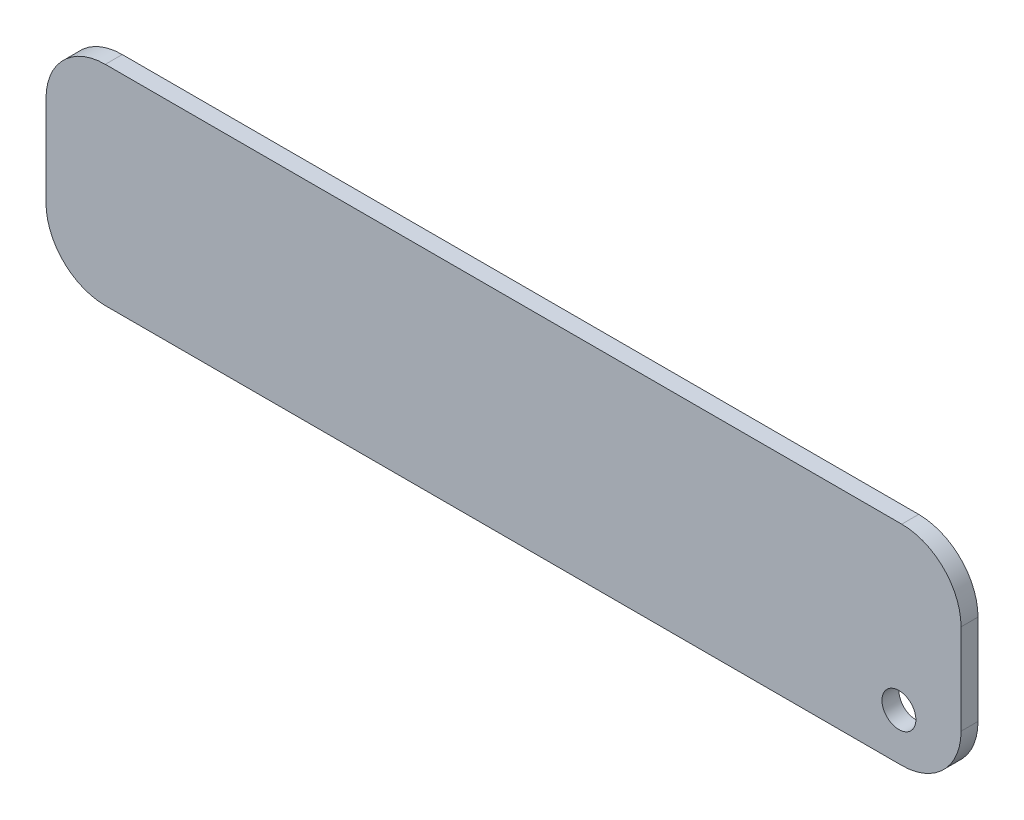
ISO-10303-21;
HEADER;
FILE_DESCRIPTION(('STEP AP214'),'2;1');
FILE_NAME('part.step','',(''),(''),'','','');
FILE_SCHEMA(('AUTOMOTIVE_DESIGN { 1 0 10303 214 1 1 1 1 }'));
ENDSEC;
DATA;
#1=APPLICATION_CONTEXT('core data for automotive mechanical design processes');
#2=APPLICATION_PROTOCOL_DEFINITION('international standard','automotive_design',2000,#1);
#3=PRODUCT_CONTEXT('',#1,'mechanical');
#4=PRODUCT('Part','Part','',(#3));
#5=PRODUCT_RELATED_PRODUCT_CATEGORY('part','',(#4));
#6=PRODUCT_DEFINITION_FORMATION('','',#4);
#7=PRODUCT_DEFINITION_CONTEXT('part definition',#1,'design');
#8=PRODUCT_DEFINITION('design','',#6,#7);
#9=PRODUCT_DEFINITION_SHAPE('','',#8);
#10=(LENGTH_UNIT() NAMED_UNIT(*) SI_UNIT(.MILLI.,.METRE.));
#11=(NAMED_UNIT(*) PLANE_ANGLE_UNIT() SI_UNIT($,.RADIAN.));
#12=(NAMED_UNIT(*) SI_UNIT($,.STERADIAN.) SOLID_ANGLE_UNIT());
#13=UNCERTAINTY_MEASURE_WITH_UNIT(LENGTH_MEASURE(1.E-05),#10,'distance_accuracy_value','');
#14=(GEOMETRIC_REPRESENTATION_CONTEXT(3) GLOBAL_UNCERTAINTY_ASSIGNED_CONTEXT((#13)) GLOBAL_UNIT_ASSIGNED_CONTEXT((#10,
#11,#12)) REPRESENTATION_CONTEXT('',''));
#15=CARTESIAN_POINT('',(0.,0.,0.));
#16=DIRECTION('',(0.,0.,1.));
#17=DIRECTION('',(1.,0.,0.));
#18=AXIS2_PLACEMENT_3D('',#15,#16,#17);
#19=CARTESIAN_POINT('',(70.5,-8.,3.));
#20=DIRECTION('',(0.,0.,-1.));
#21=DIRECTION('',(-1.,0.,0.));
#22=AXIS2_PLACEMENT_3D('',#19,#20,#21);
#23=CYLINDRICAL_SURFACE('',#22,10.5);
#24=CARTESIAN_POINT('',(70.5,-8.,0.));
#25=DIRECTION('',(0.,0.,1.));
#26=DIRECTION('',(1.,0.,0.));
#27=AXIS2_PLACEMENT_3D('',#24,#25,#26);
#28=CIRCLE('',#27,10.5);
#29=CARTESIAN_POINT('',(70.5,-18.5,0.));
#30=VERTEX_POINT('',#29);
#31=CARTESIAN_POINT('',(81.,-8.,0.));
#32=VERTEX_POINT('',#31);
#33=EDGE_CURVE('E140',#30,#32,#28,.T.);
#34=ORIENTED_EDGE('',*,*,#33,.T.);
#35=DIRECTION('',(0.,0.,-1.));
#36=VECTOR('',#35,1.);
#37=CARTESIAN_POINT('',(81.,-8.,3.));
#38=LINE('',#37,#36);
#39=CARTESIAN_POINT('',(81.,-8.,3.));
#40=VERTEX_POINT('',#39);
#41=EDGE_CURVE('E12',#40,#32,#38,.T.);
#42=ORIENTED_EDGE('',*,*,#41,.F.);
#43=CARTESIAN_POINT('',(70.5,-8.,3.));
#44=DIRECTION('',(0.,0.,1.));
#45=DIRECTION('',(1.,0.,0.));
#46=AXIS2_PLACEMENT_3D('',#43,#44,#45);
#47=CIRCLE('',#46,10.5);
#48=CARTESIAN_POINT('',(70.5,-18.5,3.));
#49=VERTEX_POINT('',#48);
#50=EDGE_CURVE('E156',#49,#40,#47,.T.);
#51=ORIENTED_EDGE('',*,*,#50,.F.);
#52=DIRECTION('',(0.,0.,-1.));
#53=VECTOR('',#52,1.);
#54=CARTESIAN_POINT('',(70.5,-18.5,3.));
#55=LINE('',#54,#53);
#56=EDGE_CURVE('E136',#49,#30,#55,.T.);
#57=ORIENTED_EDGE('',*,*,#56,.T.);
#58=EDGE_LOOP('',(#34,#42,#51,#57));
#59=FACE_BOUND('',#58,.T.);
#60=ADVANCED_FACE('F44',(#59),#23,.T.);
#61=CARTESIAN_POINT('',(81.,8.,3.));
#62=DIRECTION('',(-1.,0.,0.));
#63=DIRECTION('',(0.,-1.,0.));
#64=AXIS2_PLACEMENT_3D('',#61,#62,#63);
#65=PLANE('',#64);
#66=DIRECTION('',(0.,1.,0.));
#67=VECTOR('',#66,1.);
#68=CARTESIAN_POINT('',(81.,8.,0.));
#69=LINE('',#68,#67);
#70=CARTESIAN_POINT('',(81.,8.,0.));
#71=VERTEX_POINT('',#70);
#72=EDGE_CURVE('E143',#32,#71,#69,.T.);
#73=ORIENTED_EDGE('',*,*,#72,.T.);
#74=DIRECTION('',(0.,0.,-1.));
#75=VECTOR('',#74,1.);
#76=CARTESIAN_POINT('',(81.,8.,3.));
#77=LINE('',#76,#75);
#78=CARTESIAN_POINT('',(81.,8.,3.));
#79=VERTEX_POINT('',#78);
#80=EDGE_CURVE('E52',#79,#71,#77,.T.);
#81=ORIENTED_EDGE('',*,*,#80,.F.);
#82=DIRECTION('',(0.,1.,0.));
#83=VECTOR('',#82,1.);
#84=CARTESIAN_POINT('',(81.,8.,3.));
#85=LINE('',#84,#83);
#86=EDGE_CURVE('E103',#40,#79,#85,.T.);
#87=ORIENTED_EDGE('',*,*,#86,.F.);
#88=ORIENTED_EDGE('',*,*,#41,.T.);
#89=EDGE_LOOP('',(#73,#81,#87,#88));
#90=FACE_BOUND('',#89,.T.);
#91=ADVANCED_FACE('F214',(#90),#65,.F.);
#92=CARTESIAN_POINT('',(70.5,7.99999999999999,3.));
#93=DIRECTION('',(0.,0.,-1.));
#94=DIRECTION('',(-1.,0.,0.));
#95=AXIS2_PLACEMENT_3D('',#92,#93,#94);
#96=CYLINDRICAL_SURFACE('',#95,10.5);
#97=CARTESIAN_POINT('',(70.5,7.99999999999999,0.));
#98=DIRECTION('',(0.,0.,1.));
#99=DIRECTION('',(1.,0.,0.));
#100=AXIS2_PLACEMENT_3D('',#97,#98,#99);
#101=CIRCLE('',#100,10.5);
#102=CARTESIAN_POINT('',(70.5,18.5,0.));
#103=VERTEX_POINT('',#102);
#104=EDGE_CURVE('E146',#71,#103,#101,.T.);
#105=ORIENTED_EDGE('',*,*,#104,.T.);
#106=DIRECTION('',(0.,0.,-1.));
#107=VECTOR('',#106,1.);
#108=CARTESIAN_POINT('',(70.5,18.5,3.));
#109=LINE('',#108,#107);
#110=CARTESIAN_POINT('',(70.5,18.5,3.));
#111=VERTEX_POINT('',#110);
#112=EDGE_CURVE('E163',#111,#103,#109,.T.);
#113=ORIENTED_EDGE('',*,*,#112,.F.);
#114=CARTESIAN_POINT('',(70.5,7.99999999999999,3.));
#115=DIRECTION('',(0.,0.,1.));
#116=DIRECTION('',(1.,0.,0.));
#117=AXIS2_PLACEMENT_3D('',#114,#115,#116);
#118=CIRCLE('',#117,10.5);
#119=EDGE_CURVE('E171',#79,#111,#118,.T.);
#120=ORIENTED_EDGE('',*,*,#119,.F.);
#121=ORIENTED_EDGE('',*,*,#80,.T.);
#122=EDGE_LOOP('',(#105,#113,#120,#121));
#123=FACE_BOUND('',#122,.T.);
#124=ADVANCED_FACE('F169',(#123),#96,.T.);
#125=CARTESIAN_POINT('',(-70.5,18.5,3.));
#126=DIRECTION('',(0.,-1.,0.));
#127=DIRECTION('',(0.,0.,-1.));
#128=AXIS2_PLACEMENT_3D('',#125,#126,#127);
#129=PLANE('',#128);
#130=DIRECTION('',(-1.,0.,0.));
#131=VECTOR('',#130,1.);
#132=CARTESIAN_POINT('',(-70.5,18.5,0.));
#133=LINE('',#132,#131);
#134=CARTESIAN_POINT('',(-70.5,18.5,0.));
#135=VERTEX_POINT('',#134);
#136=EDGE_CURVE('E147',#103,#135,#133,.T.);
#137=ORIENTED_EDGE('',*,*,#136,.T.);
#138=DIRECTION('',(0.,0.,-1.));
#139=VECTOR('',#138,1.);
#140=CARTESIAN_POINT('',(-70.5,18.5,3.));
#141=LINE('',#140,#139);
#142=CARTESIAN_POINT('',(-70.5,18.5,3.));
#143=VERTEX_POINT('',#142);
#144=EDGE_CURVE('E160',#143,#135,#141,.T.);
#145=ORIENTED_EDGE('',*,*,#144,.F.);
#146=DIRECTION('',(-1.,0.,0.));
#147=VECTOR('',#146,1.);
#148=CARTESIAN_POINT('',(-70.5,18.5,3.));
#149=LINE('',#148,#147);
#150=EDGE_CURVE('E183',#111,#143,#149,.T.);
#151=ORIENTED_EDGE('',*,*,#150,.F.);
#152=ORIENTED_EDGE('',*,*,#112,.T.);
#153=EDGE_LOOP('',(#137,#145,#151,#152));
#154=FACE_BOUND('',#153,.T.);
#155=ADVANCED_FACE('F179',(#154),#129,.F.);
#156=CARTESIAN_POINT('',(-70.5,7.99999999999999,3.));
#157=DIRECTION('',(0.,0.,-1.));
#158=DIRECTION('',(-1.,0.,0.));
#159=AXIS2_PLACEMENT_3D('',#156,#157,#158);
#160=CYLINDRICAL_SURFACE('',#159,10.5);
#161=CARTESIAN_POINT('',(-70.5,7.99999999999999,0.));
#162=DIRECTION('',(0.,0.,1.));
#163=DIRECTION('',(1.,0.,0.));
#164=AXIS2_PLACEMENT_3D('',#161,#162,#163);
#165=CIRCLE('',#164,10.5);
#166=CARTESIAN_POINT('',(-81.,7.99999999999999,0.));
#167=VERTEX_POINT('',#166);
#168=EDGE_CURVE('E151',#135,#167,#165,.T.);
#169=ORIENTED_EDGE('',*,*,#168,.T.);
#170=DIRECTION('',(0.,0.,-1.));
#171=VECTOR('',#170,1.);
#172=CARTESIAN_POINT('',(-81.,7.99999999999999,3.));
#173=LINE('',#172,#171);
#174=CARTESIAN_POINT('',(-81.,7.99999999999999,3.));
#175=VERTEX_POINT('',#174);
#176=EDGE_CURVE('E131',#175,#167,#173,.T.);
#177=ORIENTED_EDGE('',*,*,#176,.F.);
#178=CARTESIAN_POINT('',(-70.5,7.99999999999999,3.));
#179=DIRECTION('',(0.,0.,1.));
#180=DIRECTION('',(1.,0.,0.));
#181=AXIS2_PLACEMENT_3D('',#178,#179,#180);
#182=CIRCLE('',#181,10.5);
#183=EDGE_CURVE('E122',#143,#175,#182,.T.);
#184=ORIENTED_EDGE('',*,*,#183,.F.);
#185=ORIENTED_EDGE('',*,*,#144,.T.);
#186=EDGE_LOOP('',(#169,#177,#184,#185));
#187=FACE_BOUND('',#186,.T.);
#188=ADVANCED_FACE('F182',(#187),#160,.T.);
#189=CARTESIAN_POINT('',(-81.,7.99999999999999,3.));
#190=DIRECTION('',(1.,0.,0.));
#191=DIRECTION('',(0.,0.,-1.));
#192=AXIS2_PLACEMENT_3D('',#189,#190,#191);
#193=PLANE('',#192);
#194=DIRECTION('',(0.,-1.,0.));
#195=VECTOR('',#194,1.);
#196=CARTESIAN_POINT('',(-81.,7.99999999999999,0.));
#197=LINE('',#196,#195);
#198=CARTESIAN_POINT('',(-81.,-8.,0.));
#199=VERTEX_POINT('',#198);
#200=EDGE_CURVE('E130',#167,#199,#197,.T.);
#201=ORIENTED_EDGE('',*,*,#200,.T.);
#202=DIRECTION('',(0.,0.,-1.));
#203=VECTOR('',#202,1.);
#204=CARTESIAN_POINT('',(-81.,-8.,3.));
#205=LINE('',#204,#203);
#206=CARTESIAN_POINT('',(-81.,-8.,3.));
#207=VERTEX_POINT('',#206);
#208=EDGE_CURVE('E127',#207,#199,#205,.T.);
#209=ORIENTED_EDGE('',*,*,#208,.F.);
#210=DIRECTION('',(0.,-1.,0.));
#211=VECTOR('',#210,1.);
#212=CARTESIAN_POINT('',(-81.,7.99999999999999,3.));
#213=LINE('',#212,#211);
#214=EDGE_CURVE('E116',#175,#207,#213,.T.);
#215=ORIENTED_EDGE('',*,*,#214,.F.);
#216=ORIENTED_EDGE('',*,*,#176,.T.);
#217=EDGE_LOOP('',(#201,#209,#215,#216));
#218=FACE_BOUND('',#217,.T.);
#219=ADVANCED_FACE('F128',(#218),#193,.F.);
#220=CARTESIAN_POINT('',(-70.5,-8.,3.));
#221=DIRECTION('',(0.,0.,-1.));
#222=DIRECTION('',(-1.,0.,0.));
#223=AXIS2_PLACEMENT_3D('',#220,#221,#222);
#224=CYLINDRICAL_SURFACE('',#223,10.5);
#225=CARTESIAN_POINT('',(-70.5,-8.,0.));
#226=DIRECTION('',(0.,0.,1.));
#227=DIRECTION('',(1.,0.,0.));
#228=AXIS2_PLACEMENT_3D('',#225,#226,#227);
#229=CIRCLE('',#228,10.5);
#230=CARTESIAN_POINT('',(-70.5,-18.5,0.));
#231=VERTEX_POINT('',#230);
#232=EDGE_CURVE('E89',#199,#231,#229,.T.);
#233=ORIENTED_EDGE('',*,*,#232,.T.);
#234=DIRECTION('',(0.,0.,-1.));
#235=VECTOR('',#234,1.);
#236=CARTESIAN_POINT('',(-70.5,-18.5,3.));
#237=LINE('',#236,#235);
#238=CARTESIAN_POINT('',(-70.5,-18.5,3.));
#239=VERTEX_POINT('',#238);
#240=EDGE_CURVE('E132',#239,#231,#237,.T.);
#241=ORIENTED_EDGE('',*,*,#240,.F.);
#242=CARTESIAN_POINT('',(-70.5,-8.,3.));
#243=DIRECTION('',(0.,0.,1.));
#244=DIRECTION('',(1.,0.,0.));
#245=AXIS2_PLACEMENT_3D('',#242,#243,#244);
#246=CIRCLE('',#245,10.5);
#247=EDGE_CURVE('E120',#207,#239,#246,.T.);
#248=ORIENTED_EDGE('',*,*,#247,.F.);
#249=ORIENTED_EDGE('',*,*,#208,.T.);
#250=EDGE_LOOP('',(#233,#241,#248,#249));
#251=FACE_BOUND('',#250,.T.);
#252=ADVANCED_FACE('F134',(#251),#224,.T.);
#253=CARTESIAN_POINT('',(-70.5,-18.5,3.));
#254=DIRECTION('',(0.,1.,0.));
#255=DIRECTION('',(0.,0.,1.));
#256=AXIS2_PLACEMENT_3D('',#253,#254,#255);
#257=PLANE('',#256);
#258=DIRECTION('',(1.,0.,0.));
#259=VECTOR('',#258,1.);
#260=CARTESIAN_POINT('',(-70.5,-18.5,0.));
#261=LINE('',#260,#259);
#262=EDGE_CURVE('E95',#231,#30,#261,.T.);
#263=ORIENTED_EDGE('',*,*,#262,.T.);
#264=ORIENTED_EDGE('',*,*,#56,.F.);
#265=DIRECTION('',(1.,0.,0.));
#266=VECTOR('',#265,1.);
#267=CARTESIAN_POINT('',(-70.5,-18.5,3.));
#268=LINE('',#267,#266);
#269=EDGE_CURVE('E60',#239,#49,#268,.T.);
#270=ORIENTED_EDGE('',*,*,#269,.F.);
#271=ORIENTED_EDGE('',*,*,#240,.T.);
#272=EDGE_LOOP('',(#263,#264,#270,#271));
#273=FACE_BOUND('',#272,.T.);
#274=ADVANCED_FACE('F205',(#273),#257,.F.);
#275=CARTESIAN_POINT('',(70.5,-8.,3.));
#276=DIRECTION('',(0.,0.,1.));
#277=DIRECTION('',(1.,0.,0.));
#278=AXIS2_PLACEMENT_3D('',#275,#276,#277);
#279=PLANE('',#278);
#280=CARTESIAN_POINT('',(70.,-10.25,3.));
#281=DIRECTION('',(0.,0.,1.));
#282=DIRECTION('',(1.,0.,0.));
#283=AXIS2_PLACEMENT_3D('',#280,#281,#282);
#284=CIRCLE('',#283,3.00000000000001);
#285=CARTESIAN_POINT('',(73.,-10.25,3.));
#286=VERTEX_POINT('',#285);
#287=EDGE_CURVE('E189',#286,#286,#284,.T.);
#288=ORIENTED_EDGE('',*,*,#287,.F.);
#289=EDGE_LOOP('',(#288));
#290=FACE_BOUND('',#289,.T.);
#291=ORIENTED_EDGE('',*,*,#50,.T.);
#292=ORIENTED_EDGE('',*,*,#86,.T.);
#293=ORIENTED_EDGE('',*,*,#119,.T.);
#294=ORIENTED_EDGE('',*,*,#150,.T.);
#295=ORIENTED_EDGE('',*,*,#183,.T.);
#296=ORIENTED_EDGE('',*,*,#214,.T.);
#297=ORIENTED_EDGE('',*,*,#247,.T.);
#298=ORIENTED_EDGE('',*,*,#269,.T.);
#299=EDGE_LOOP('',(#291,#292,#293,#294,#295,#296,#297,#298));
#300=FACE_BOUND('',#299,.T.);
#301=ADVANCED_FACE('F118',(#290,#300),#279,.T.);
#302=CARTESIAN_POINT('',(70.5,-8.,0.));
#303=DIRECTION('',(0.,0.,1.));
#304=DIRECTION('',(1.,0.,0.));
#305=AXIS2_PLACEMENT_3D('',#302,#303,#304);
#306=PLANE('',#305);
#307=CARTESIAN_POINT('',(70.,-10.25,0.));
#308=DIRECTION('',(0.,0.,1.));
#309=DIRECTION('',(1.,0.,0.));
#310=AXIS2_PLACEMENT_3D('',#307,#308,#309);
#311=CIRCLE('',#310,3.00000000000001);
#312=CARTESIAN_POINT('',(73.,-10.25,0.));
#313=VERTEX_POINT('',#312);
#314=EDGE_CURVE('E144',#313,#313,#311,.T.);
#315=ORIENTED_EDGE('',*,*,#314,.T.);
#316=EDGE_LOOP('',(#315));
#317=FACE_BOUND('',#316,.T.);
#318=ORIENTED_EDGE('',*,*,#33,.F.);
#319=ORIENTED_EDGE('',*,*,#262,.F.);
#320=ORIENTED_EDGE('',*,*,#232,.F.);
#321=ORIENTED_EDGE('',*,*,#200,.F.);
#322=ORIENTED_EDGE('',*,*,#168,.F.);
#323=ORIENTED_EDGE('',*,*,#136,.F.);
#324=ORIENTED_EDGE('',*,*,#104,.F.);
#325=ORIENTED_EDGE('',*,*,#72,.F.);
#326=EDGE_LOOP('',(#318,#319,#320,#321,#322,#323,#324,#325));
#327=FACE_BOUND('',#326,.T.);
#328=ADVANCED_FACE('F175',(#317,#327),#306,.F.);
#329=CARTESIAN_POINT('',(70.,-10.25,0.));
#330=DIRECTION('',(0.,0.,1.));
#331=DIRECTION('',(1.,0.,0.));
#332=AXIS2_PLACEMENT_3D('',#329,#330,#331);
#333=CYLINDRICAL_SURFACE('',#332,3.00000000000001);
#334=ORIENTED_EDGE('',*,*,#314,.F.);
#335=EDGE_LOOP('',(#334));
#336=FACE_BOUND('',#335,.T.);
#337=ORIENTED_EDGE('',*,*,#287,.T.);
#338=EDGE_LOOP('',(#337));
#339=FACE_BOUND('',#338,.T.);
#340=ADVANCED_FACE('F198',(#336,#339),#333,.F.);
#341=CLOSED_SHELL('',(#60,#91,#124,#155,#188,#219,#252,#274,#301,#328,#340));
#342=MANIFOLD_SOLID_BREP('B2',#341);
#343=ADVANCED_BREP_SHAPE_REPRESENTATION('',(#18,#342),#14);
#344=SHAPE_DEFINITION_REPRESENTATION(#9,#343);
ENDSEC;
END-ISO-10303-21;
